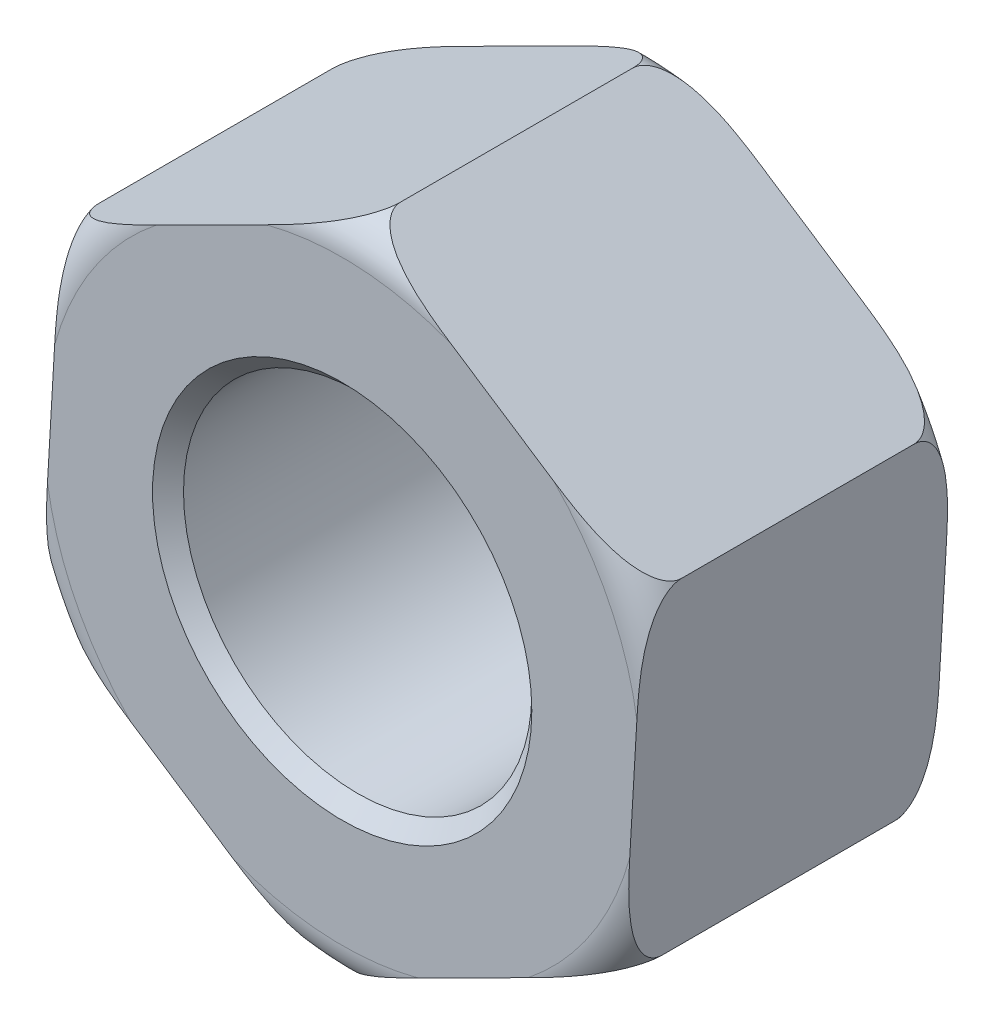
from build123d import *

# Parameters (mm, degrees)
ESQUISSE1_R             = 4.35
ESQUISSE1_R_2           = 2.25
EXTRUSION1_DEPTH        = 4
CONG_1_R                = 0.5
ESQUISSE2_OUTSIDE_W     = 13.288
ESQUISSE2_OUTSIDE_H     = 13.288
ENL_V_MAT_EXTRU_1_DEPTH = 4
CHANFREIN1_SIZE         = 0.2


with BuildPart() as part:
    # Esquisse1 → Extrusion1 (new body)
    with BuildSketch(Plane.XY):
        Circle(ESQUISSE1_R)
        Circle(ESQUISSE1_R_2, mode=Mode.SUBTRACT)
    extrude(amount=EXTRUSION1_DEPTH)

    # Cong_1
    cong_1_edges = [part.edges().sort_by_distance(p)[0] for p in [
        (-4.35, 0, 0),
        (-4.35, 0, 4),
    ]]
    fillet(cong_1_edges, radius=CONG_1_R)

    # Esquisse2 outside → Enl_v. mat.-Extru.1 (cut)
    with BuildSketch(Plane.XY.offset(4)):
        Rectangle(ESQUISSE2_OUTSIDE_W, ESQUISSE2_OUTSIDE_H)
        Polygon((3.8871115, 1.952655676), (0.25250633, 4.342665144), (-3.63460517, 2.390009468), (-3.8871115, -1.952655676), (-0.25250633, -4.342665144), (3.63460517, -2.390009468), align=None, mode=Mode.SUBTRACT)
    extrude(amount=-ENL_V_MAT_EXTRU_1_DEPTH, mode=Mode.SUBTRACT)

    # Chanfrein1
    chanfrein1_edges = [part.edges().sort_by_distance(p)[0] for p in [
        (-2.25, 0, 0),
        (-2.25, 0, 4),
    ]]
    chamfer(chanfrein1_edges, length=CHANFREIN1_SIZE)


solid = part.part
